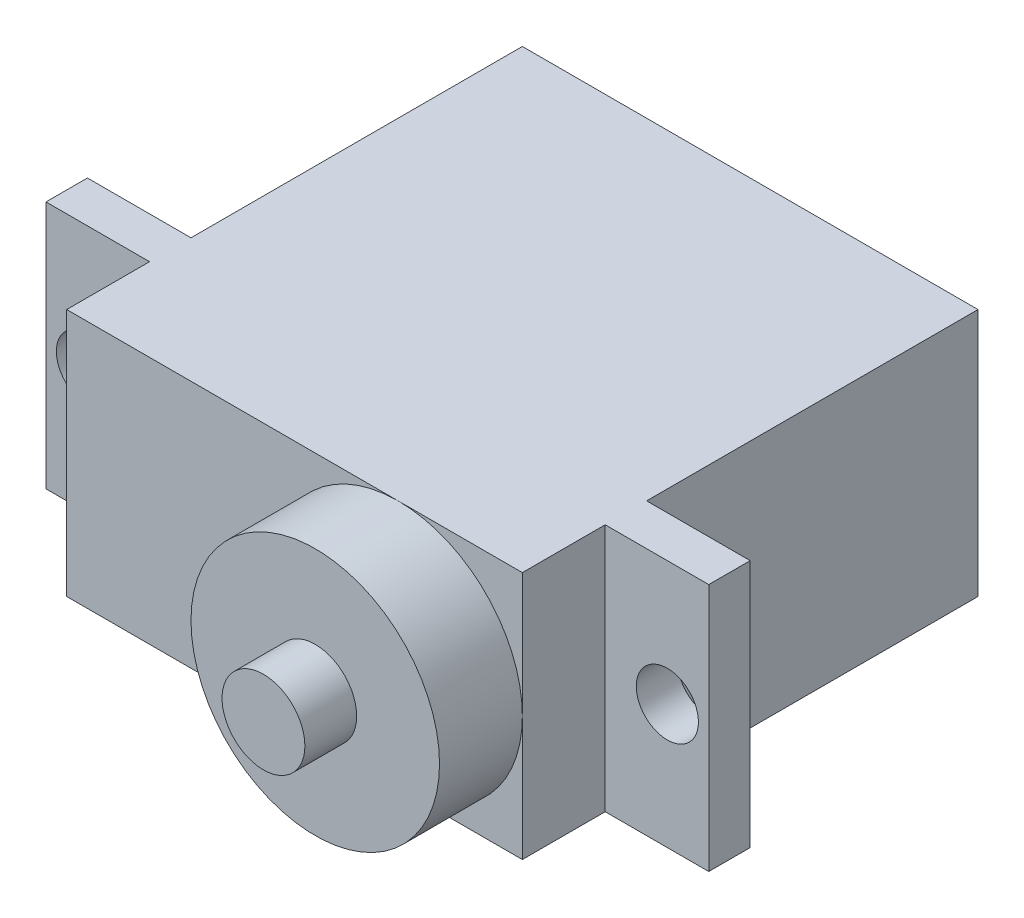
ISO-10303-21;
HEADER;
FILE_DESCRIPTION(('STEP AP214'),'2;1');
FILE_NAME('part.step','',(''),(''),'','','');
FILE_SCHEMA(('AUTOMOTIVE_DESIGN { 1 0 10303 214 1 1 1 1 }'));
ENDSEC;
DATA;
#1=APPLICATION_CONTEXT('core data for automotive mechanical design processes');
#2=APPLICATION_PROTOCOL_DEFINITION('international standard','automotive_design',2000,#1);
#3=PRODUCT_CONTEXT('',#1,'mechanical');
#4=PRODUCT('Part','Part','',(#3));
#5=PRODUCT_RELATED_PRODUCT_CATEGORY('part','',(#4));
#6=PRODUCT_DEFINITION_FORMATION('','',#4);
#7=PRODUCT_DEFINITION_CONTEXT('part definition',#1,'design');
#8=PRODUCT_DEFINITION('design','',#6,#7);
#9=PRODUCT_DEFINITION_SHAPE('','',#8);
#10=(LENGTH_UNIT() NAMED_UNIT(*) SI_UNIT(.MILLI.,.METRE.));
#11=(NAMED_UNIT(*) PLANE_ANGLE_UNIT() SI_UNIT($,.RADIAN.));
#12=(NAMED_UNIT(*) SI_UNIT($,.STERADIAN.) SOLID_ANGLE_UNIT());
#13=UNCERTAINTY_MEASURE_WITH_UNIT(LENGTH_MEASURE(1.E-05),#10,'distance_accuracy_value','');
#14=(GEOMETRIC_REPRESENTATION_CONTEXT(3) GLOBAL_UNCERTAINTY_ASSIGNED_CONTEXT((#13)) GLOBAL_UNIT_ASSIGNED_CONTEXT((#10,
#11,#12)) REPRESENTATION_CONTEXT('',''));
#15=CARTESIAN_POINT('',(0.,0.,0.));
#16=DIRECTION('',(0.,0.,1.));
#17=DIRECTION('',(1.,0.,0.));
#18=AXIS2_PLACEMENT_3D('',#15,#16,#17);
#19=CARTESIAN_POINT('',(0.,0.,22.));
#20=DIRECTION('',(0.,0.,1.));
#21=DIRECTION('',(1.,0.,0.));
#22=AXIS2_PLACEMENT_3D('',#19,#20,#21);
#23=PLANE('',#22);
#24=CARTESIAN_POINT('',(-1.83967744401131,2.32380952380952,22.));
#25=DIRECTION('',(0.,0.,1.));
#26=DIRECTION('',(1.,0.,0.));
#27=AXIS2_PLACEMENT_3D('',#24,#25,#26);
#28=CIRCLE('',#27,6.);
#29=CARTESIAN_POINT('',(4.16032255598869,2.32380952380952,22.));
#30=VERTEX_POINT('',#29);
#31=CARTESIAN_POINT('',(-1.83967744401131,8.32380952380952,22.));
#32=VERTEX_POINT('',#31);
#33=EDGE_CURVE('E44',#30,#32,#28,.T.);
#34=ORIENTED_EDGE('',*,*,#33,.F.);
#35=DIRECTION('',(0.,1.,0.));
#36=VECTOR('',#35,1.);
#37=CARTESIAN_POINT('',(4.16032255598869,8.32380952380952,22.));
#38=LINE('',#37,#36);
#39=CARTESIAN_POINT('',(4.16032255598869,8.32380952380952,22.));
#40=VERTEX_POINT('',#39);
#41=EDGE_CURVE('E137',#30,#40,#38,.T.);
#42=ORIENTED_EDGE('',*,*,#41,.T.);
#43=DIRECTION('',(-1.,0.,0.));
#44=VECTOR('',#43,1.);
#45=CARTESIAN_POINT('',(-17.8396774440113,8.32380952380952,22.));
#46=LINE('',#45,#44);
#47=EDGE_CURVE('E149',#40,#32,#46,.T.);
#48=ORIENTED_EDGE('',*,*,#47,.T.);
#49=EDGE_LOOP('',(#34,#42,#48));
#50=FACE_BOUND('',#49,.T.);
#51=ADVANCED_FACE('F33',(#50),#23,.T.);
#52=CARTESIAN_POINT('',(-1.83967744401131,-3.67619047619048,22.));
#53=VERTEX_POINT('',#52);
#54=EDGE_CURVE('E11',#32,#53,#28,.T.);
#55=ORIENTED_EDGE('',*,*,#54,.F.);
#56=CARTESIAN_POINT('',(-17.8396774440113,8.32380952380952,22.));
#57=VERTEX_POINT('',#56);
#58=EDGE_CURVE('E136',#32,#57,#46,.T.);
#59=ORIENTED_EDGE('',*,*,#58,.T.);
#60=DIRECTION('',(0.,-1.,0.));
#61=VECTOR('',#60,1.);
#62=CARTESIAN_POINT('',(-17.8396774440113,8.32380952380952,22.));
#63=LINE('',#62,#61);
#64=CARTESIAN_POINT('',(-17.8396774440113,-3.67619047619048,22.));
#65=VERTEX_POINT('',#64);
#66=EDGE_CURVE('E214',#57,#65,#63,.T.);
#67=ORIENTED_EDGE('',*,*,#66,.T.);
#68=DIRECTION('',(1.,0.,0.));
#69=VECTOR('',#68,1.);
#70=CARTESIAN_POINT('',(-17.8396774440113,-3.67619047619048,22.));
#71=LINE('',#70,#69);
#72=EDGE_CURVE('E147',#65,#53,#71,.T.);
#73=ORIENTED_EDGE('',*,*,#72,.T.);
#74=EDGE_LOOP('',(#55,#59,#67,#73));
#75=FACE_BOUND('',#74,.T.);
#76=ADVANCED_FACE('F266',(#75),#23,.T.);
#77=CARTESIAN_POINT('',(-17.8396774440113,8.32380952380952,22.));
#78=DIRECTION('',(1.,0.,0.));
#79=DIRECTION('',(0.,0.,-1.));
#80=AXIS2_PLACEMENT_3D('',#77,#78,#79);
#81=PLANE('',#80);
#82=DIRECTION('',(0.,1.,0.));
#83=VECTOR('',#82,1.);
#84=CARTESIAN_POINT('',(-17.8396774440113,8.32380952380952,18.));
#85=LINE('',#84,#83);
#86=CARTESIAN_POINT('',(-17.8396774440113,-3.67619047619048,18.));
#87=VERTEX_POINT('',#86);
#88=CARTESIAN_POINT('',(-17.8396774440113,8.32380952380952,18.));
#89=VERTEX_POINT('',#88);
#90=EDGE_CURVE('E170',#87,#89,#85,.T.);
#91=ORIENTED_EDGE('',*,*,#90,.F.);
#92=DIRECTION('',(0.,0.,-1.));
#93=VECTOR('',#92,1.);
#94=CARTESIAN_POINT('',(-17.8396774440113,-3.67619047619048,22.));
#95=LINE('',#94,#93);
#96=EDGE_CURVE('E37',#65,#87,#95,.T.);
#97=ORIENTED_EDGE('',*,*,#96,.F.);
#98=ORIENTED_EDGE('',*,*,#66,.F.);
#99=DIRECTION('',(0.,0.,-1.));
#100=VECTOR('',#99,1.);
#101=CARTESIAN_POINT('',(-17.8396774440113,8.32380952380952,22.));
#102=LINE('',#101,#100);
#103=EDGE_CURVE('E231',#57,#89,#102,.T.);
#104=ORIENTED_EDGE('',*,*,#103,.T.);
#105=EDGE_LOOP('',(#91,#97,#98,#104));
#106=FACE_BOUND('',#105,.T.);
#107=ADVANCED_FACE('F35',(#106),#81,.F.);
#108=DIRECTION('',(0.,-1.,0.));
#109=VECTOR('',#108,1.);
#110=CARTESIAN_POINT('',(-17.8396774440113,8.32380952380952,16.));
#111=LINE('',#110,#109);
#112=CARTESIAN_POINT('',(-17.8396774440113,8.32380952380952,16.));
#113=VERTEX_POINT('',#112);
#114=CARTESIAN_POINT('',(-17.8396774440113,-3.67619047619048,16.));
#115=VERTEX_POINT('',#114);
#116=EDGE_CURVE('E163',#113,#115,#111,.T.);
#117=ORIENTED_EDGE('',*,*,#116,.F.);
#118=CARTESIAN_POINT('',(-17.8396774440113,8.32380952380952,0.));
#119=VERTEX_POINT('',#118);
#120=EDGE_CURVE('E220',#113,#119,#102,.T.);
#121=ORIENTED_EDGE('',*,*,#120,.T.);
#122=DIRECTION('',(0.,-1.,0.));
#123=VECTOR('',#122,1.);
#124=CARTESIAN_POINT('',(-17.8396774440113,8.32380952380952,0.));
#125=LINE('',#124,#123);
#126=CARTESIAN_POINT('',(-17.8396774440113,-3.67619047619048,0.));
#127=VERTEX_POINT('',#126);
#128=EDGE_CURVE('E213',#119,#127,#125,.T.);
#129=ORIENTED_EDGE('',*,*,#128,.T.);
#130=EDGE_CURVE('E155',#115,#127,#95,.T.);
#131=ORIENTED_EDGE('',*,*,#130,.F.);
#132=EDGE_LOOP('',(#117,#121,#129,#131));
#133=FACE_BOUND('',#132,.T.);
#134=ADVANCED_FACE('F282',(#133),#81,.F.);
#135=CARTESIAN_POINT('',(4.16032255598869,8.32380952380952,22.));
#136=DIRECTION('',(-1.,0.,0.));
#137=DIRECTION('',(0.,-1.,0.));
#138=AXIS2_PLACEMENT_3D('',#135,#136,#137);
#139=PLANE('',#138);
#140=DIRECTION('',(0.,-1.,0.));
#141=VECTOR('',#140,1.);
#142=CARTESIAN_POINT('',(4.16032255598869,8.32380952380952,18.));
#143=LINE('',#142,#141);
#144=CARTESIAN_POINT('',(4.16032255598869,8.32380952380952,18.));
#145=VERTEX_POINT('',#144);
#146=CARTESIAN_POINT('',(4.16032255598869,-3.67619047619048,18.));
#147=VERTEX_POINT('',#146);
#148=EDGE_CURVE('E186',#145,#147,#143,.T.);
#149=ORIENTED_EDGE('',*,*,#148,.F.);
#150=DIRECTION('',(0.,0.,-1.));
#151=VECTOR('',#150,1.);
#152=CARTESIAN_POINT('',(4.16032255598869,8.32380952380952,22.));
#153=LINE('',#152,#151);
#154=EDGE_CURVE('E143',#40,#145,#153,.T.);
#155=ORIENTED_EDGE('',*,*,#154,.F.);
#156=ORIENTED_EDGE('',*,*,#41,.F.);
#157=CARTESIAN_POINT('',(4.16032255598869,-3.67619047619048,22.));
#158=VERTEX_POINT('',#157);
#159=EDGE_CURVE('E130',#158,#30,#38,.T.);
#160=ORIENTED_EDGE('',*,*,#159,.F.);
#161=DIRECTION('',(0.,0.,-1.));
#162=VECTOR('',#161,1.);
#163=CARTESIAN_POINT('',(4.16032255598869,-3.67619047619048,22.));
#164=LINE('',#163,#162);
#165=EDGE_CURVE('E235',#158,#147,#164,.T.);
#166=ORIENTED_EDGE('',*,*,#165,.T.);
#167=EDGE_LOOP('',(#149,#155,#156,#160,#166));
#168=FACE_BOUND('',#167,.T.);
#169=ADVANCED_FACE('F141',(#168),#139,.F.);
#170=DIRECTION('',(0.,1.,0.));
#171=VECTOR('',#170,1.);
#172=CARTESIAN_POINT('',(4.16032255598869,8.32380952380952,16.));
#173=LINE('',#172,#171);
#174=CARTESIAN_POINT('',(4.16032255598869,-3.67619047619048,16.));
#175=VERTEX_POINT('',#174);
#176=CARTESIAN_POINT('',(4.16032255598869,8.32380952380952,16.));
#177=VERTEX_POINT('',#176);
#178=EDGE_CURVE('E191',#175,#177,#173,.T.);
#179=ORIENTED_EDGE('',*,*,#178,.F.);
#180=CARTESIAN_POINT('',(4.16032255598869,-3.67619047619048,0.));
#181=VERTEX_POINT('',#180);
#182=EDGE_CURVE('E234',#175,#181,#164,.T.);
#183=ORIENTED_EDGE('',*,*,#182,.T.);
#184=DIRECTION('',(0.,1.,0.));
#185=VECTOR('',#184,1.);
#186=CARTESIAN_POINT('',(4.16032255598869,8.32380952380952,0.));
#187=LINE('',#186,#185);
#188=CARTESIAN_POINT('',(4.16032255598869,8.32380952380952,0.));
#189=VERTEX_POINT('',#188);
#190=EDGE_CURVE('E226',#181,#189,#187,.T.);
#191=ORIENTED_EDGE('',*,*,#190,.T.);
#192=EDGE_CURVE('E233',#177,#189,#153,.T.);
#193=ORIENTED_EDGE('',*,*,#192,.F.);
#194=EDGE_LOOP('',(#179,#183,#191,#193));
#195=FACE_BOUND('',#194,.T.);
#196=ADVANCED_FACE('F238',(#195),#139,.F.);
#197=CARTESIAN_POINT('',(-17.8396774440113,-3.67619047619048,22.));
#198=DIRECTION('',(0.,1.,0.));
#199=DIRECTION('',(0.,0.,1.));
#200=AXIS2_PLACEMENT_3D('',#197,#198,#199);
#201=PLANE('',#200);
#202=DIRECTION('',(1.,0.,0.));
#203=VECTOR('',#202,1.);
#204=CARTESIAN_POINT('',(-17.8396774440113,-3.67619047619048,0.));
#205=LINE('',#204,#203);
#206=EDGE_CURVE('E223',#127,#181,#205,.T.);
#207=ORIENTED_EDGE('',*,*,#206,.T.);
#208=ORIENTED_EDGE('',*,*,#182,.F.);
#209=DIRECTION('',(-1.,0.,0.));
#210=VECTOR('',#209,1.);
#211=CARTESIAN_POINT('',(9.16032255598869,-3.67619047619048,16.));
#212=LINE('',#211,#210);
#213=CARTESIAN_POINT('',(9.16032255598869,-3.67619047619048,16.));
#214=VERTEX_POINT('',#213);
#215=EDGE_CURVE('E207',#214,#175,#212,.T.);
#216=ORIENTED_EDGE('',*,*,#215,.F.);
#217=DIRECTION('',(0.,0.,-1.));
#218=VECTOR('',#217,1.);
#219=CARTESIAN_POINT('',(9.16032255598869,-3.67619047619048,18.));
#220=LINE('',#219,#218);
#221=CARTESIAN_POINT('',(9.16032255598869,-3.67619047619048,18.));
#222=VERTEX_POINT('',#221);
#223=EDGE_CURVE('E190',#222,#214,#220,.T.);
#224=ORIENTED_EDGE('',*,*,#223,.F.);
#225=DIRECTION('',(-1.,0.,0.));
#226=VECTOR('',#225,1.);
#227=CARTESIAN_POINT('',(9.16032255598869,-3.67619047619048,18.));
#228=LINE('',#227,#226);
#229=EDGE_CURVE('E210',#222,#147,#228,.T.);
#230=ORIENTED_EDGE('',*,*,#229,.T.);
#231=ORIENTED_EDGE('',*,*,#165,.F.);
#232=EDGE_CURVE('E133',#53,#158,#71,.T.);
#233=ORIENTED_EDGE('',*,*,#232,.F.);
#234=ORIENTED_EDGE('',*,*,#72,.F.);
#235=ORIENTED_EDGE('',*,*,#96,.T.);
#236=DIRECTION('',(1.,0.,0.));
#237=VECTOR('',#236,1.);
#238=CARTESIAN_POINT('',(-22.8396774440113,-3.67619047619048,18.));
#239=LINE('',#238,#237);
#240=CARTESIAN_POINT('',(-22.8396774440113,-3.67619047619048,18.));
#241=VERTEX_POINT('',#240);
#242=EDGE_CURVE('E169',#241,#87,#239,.T.);
#243=ORIENTED_EDGE('',*,*,#242,.F.);
#244=DIRECTION('',(0.,0.,1.));
#245=VECTOR('',#244,1.);
#246=CARTESIAN_POINT('',(-22.8396774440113,-3.67619047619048,18.));
#247=LINE('',#246,#245);
#248=CARTESIAN_POINT('',(-22.8396774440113,-3.67619047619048,16.));
#249=VERTEX_POINT('',#248);
#250=EDGE_CURVE('E167',#249,#241,#247,.T.);
#251=ORIENTED_EDGE('',*,*,#250,.F.);
#252=DIRECTION('',(1.,0.,0.));
#253=VECTOR('',#252,1.);
#254=CARTESIAN_POINT('',(-22.8396774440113,-3.67619047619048,16.));
#255=LINE('',#254,#253);
#256=EDGE_CURVE('E177',#249,#115,#255,.T.);
#257=ORIENTED_EDGE('',*,*,#256,.T.);
#258=ORIENTED_EDGE('',*,*,#130,.T.);
#259=EDGE_LOOP('',(#207,#208,#216,#224,#230,#231,#233,#234,#235,#243,#251,#257,#258));
#260=FACE_BOUND('',#259,.T.);
#261=ADVANCED_FACE('F244',(#260),#201,.F.);
#262=CARTESIAN_POINT('',(-17.8396774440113,8.32380952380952,22.));
#263=DIRECTION('',(0.,-1.,0.));
#264=DIRECTION('',(0.,0.,-1.));
#265=AXIS2_PLACEMENT_3D('',#262,#263,#264);
#266=PLANE('',#265);
#267=DIRECTION('',(-1.,0.,0.));
#268=VECTOR('',#267,1.);
#269=CARTESIAN_POINT('',(-17.8396774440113,8.32380952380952,0.));
#270=LINE('',#269,#268);
#271=EDGE_CURVE('E217',#189,#119,#270,.T.);
#272=ORIENTED_EDGE('',*,*,#271,.T.);
#273=ORIENTED_EDGE('',*,*,#120,.F.);
#274=DIRECTION('',(1.,0.,0.));
#275=VECTOR('',#274,1.);
#276=CARTESIAN_POINT('',(-22.8396774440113,8.32380952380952,16.));
#277=LINE('',#276,#275);
#278=CARTESIAN_POINT('',(-22.8396774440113,8.32380952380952,16.));
#279=VERTEX_POINT('',#278);
#280=EDGE_CURVE('E180',#279,#113,#277,.T.);
#281=ORIENTED_EDGE('',*,*,#280,.F.);
#282=DIRECTION('',(0.,0.,-1.));
#283=VECTOR('',#282,1.);
#284=CARTESIAN_POINT('',(-22.8396774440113,8.32380952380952,18.));
#285=LINE('',#284,#283);
#286=CARTESIAN_POINT('',(-22.8396774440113,8.32380952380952,18.));
#287=VERTEX_POINT('',#286);
#288=EDGE_CURVE('E162',#287,#279,#285,.T.);
#289=ORIENTED_EDGE('',*,*,#288,.F.);
#290=DIRECTION('',(1.,0.,0.));
#291=VECTOR('',#290,1.);
#292=CARTESIAN_POINT('',(-22.8396774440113,8.32380952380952,18.));
#293=LINE('',#292,#291);
#294=EDGE_CURVE('E183',#287,#89,#293,.T.);
#295=ORIENTED_EDGE('',*,*,#294,.T.);
#296=ORIENTED_EDGE('',*,*,#103,.F.);
#297=ORIENTED_EDGE('',*,*,#58,.F.);
#298=ORIENTED_EDGE('',*,*,#47,.F.);
#299=ORIENTED_EDGE('',*,*,#154,.T.);
#300=DIRECTION('',(-1.,0.,0.));
#301=VECTOR('',#300,1.);
#302=CARTESIAN_POINT('',(9.16032255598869,8.32380952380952,18.));
#303=LINE('',#302,#301);
#304=CARTESIAN_POINT('',(9.16032255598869,8.32380952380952,18.));
#305=VERTEX_POINT('',#304);
#306=EDGE_CURVE('E197',#305,#145,#303,.T.);
#307=ORIENTED_EDGE('',*,*,#306,.F.);
#308=DIRECTION('',(0.,0.,1.));
#309=VECTOR('',#308,1.);
#310=CARTESIAN_POINT('',(9.16032255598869,8.32380952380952,18.));
#311=LINE('',#310,#309);
#312=CARTESIAN_POINT('',(9.16032255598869,8.32380952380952,16.));
#313=VERTEX_POINT('',#312);
#314=EDGE_CURVE('E195',#313,#305,#311,.T.);
#315=ORIENTED_EDGE('',*,*,#314,.F.);
#316=DIRECTION('',(-1.,0.,0.));
#317=VECTOR('',#316,1.);
#318=CARTESIAN_POINT('',(9.16032255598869,8.32380952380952,16.));
#319=LINE('',#318,#317);
#320=EDGE_CURVE('E204',#313,#177,#319,.T.);
#321=ORIENTED_EDGE('',*,*,#320,.T.);
#322=ORIENTED_EDGE('',*,*,#192,.T.);
#323=EDGE_LOOP('',(#272,#273,#281,#289,#295,#296,#297,#298,#299,#307,#315,#321,#322));
#324=FACE_BOUND('',#323,.T.);
#325=ADVANCED_FACE('F250',(#324),#266,.F.);
#326=EDGE_CURVE('E42',#53,#30,#28,.T.);
#327=ORIENTED_EDGE('',*,*,#326,.F.);
#328=ORIENTED_EDGE('',*,*,#232,.T.);
#329=ORIENTED_EDGE('',*,*,#159,.T.);
#330=EDGE_LOOP('',(#327,#328,#329));
#331=FACE_BOUND('',#330,.T.);
#332=ADVANCED_FACE('F132',(#331),#23,.T.);
#333=CARTESIAN_POINT('',(0.,0.,0.));
#334=DIRECTION('',(0.,0.,1.));
#335=DIRECTION('',(1.,0.,0.));
#336=AXIS2_PLACEMENT_3D('',#333,#334,#335);
#337=PLANE('',#336);
#338=ORIENTED_EDGE('',*,*,#128,.F.);
#339=ORIENTED_EDGE('',*,*,#271,.F.);
#340=ORIENTED_EDGE('',*,*,#190,.F.);
#341=ORIENTED_EDGE('',*,*,#206,.F.);
#342=EDGE_LOOP('',(#338,#339,#340,#341));
#343=FACE_BOUND('',#342,.T.);
#344=ADVANCED_FACE('F247',(#343),#337,.F.);
#345=CARTESIAN_POINT('',(9.16032255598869,8.32380952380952,18.));
#346=DIRECTION('',(0.,0.,-1.));
#347=DIRECTION('',(-1.,0.,0.));
#348=AXIS2_PLACEMENT_3D('',#345,#346,#347);
#349=PLANE('',#348);
#350=CARTESIAN_POINT('',(7.16032255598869,2.32380952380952,18.));
#351=DIRECTION('',(0.,0.,1.));
#352=DIRECTION('',(1.,0.,0.));
#353=AXIS2_PLACEMENT_3D('',#350,#351,#352);
#354=CIRCLE('',#353,1.5);
#355=CARTESIAN_POINT('',(8.66032255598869,2.32380952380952,18.));
#356=VERTEX_POINT('',#355);
#357=EDGE_CURVE('E472',#356,#356,#354,.T.);
#358=ORIENTED_EDGE('',*,*,#357,.F.);
#359=EDGE_LOOP('',(#358));
#360=FACE_BOUND('',#359,.T.);
#361=ORIENTED_EDGE('',*,*,#148,.T.);
#362=ORIENTED_EDGE('',*,*,#229,.F.);
#363=DIRECTION('',(0.,-1.,0.));
#364=VECTOR('',#363,1.);
#365=CARTESIAN_POINT('',(9.16032255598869,8.32380952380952,18.));
#366=LINE('',#365,#364);
#367=EDGE_CURVE('E187',#305,#222,#366,.T.);
#368=ORIENTED_EDGE('',*,*,#367,.F.);
#369=ORIENTED_EDGE('',*,*,#306,.T.);
#370=EDGE_LOOP('',(#361,#362,#368,#369));
#371=FACE_BOUND('',#370,.T.);
#372=ADVANCED_FACE('F263',(#360,#371),#349,.F.);
#373=CARTESIAN_POINT('',(9.16032255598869,8.32380952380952,16.));
#374=DIRECTION('',(0.,0.,1.));
#375=DIRECTION('',(1.,0.,0.));
#376=AXIS2_PLACEMENT_3D('',#373,#374,#375);
#377=PLANE('',#376);
#378=CARTESIAN_POINT('',(7.16032255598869,2.32380952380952,16.));
#379=DIRECTION('',(0.,0.,1.));
#380=DIRECTION('',(1.,0.,0.));
#381=AXIS2_PLACEMENT_3D('',#378,#379,#380);
#382=CIRCLE('',#381,1.5);
#383=CARTESIAN_POINT('',(8.66032255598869,2.32380952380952,16.));
#384=VERTEX_POINT('',#383);
#385=EDGE_CURVE('E475',#384,#384,#382,.F.);
#386=ORIENTED_EDGE('',*,*,#385,.F.);
#387=EDGE_LOOP('',(#386));
#388=FACE_BOUND('',#387,.T.);
#389=ORIENTED_EDGE('',*,*,#178,.T.);
#390=ORIENTED_EDGE('',*,*,#320,.F.);
#391=DIRECTION('',(0.,1.,0.));
#392=VECTOR('',#391,1.);
#393=CARTESIAN_POINT('',(9.16032255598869,8.32380952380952,16.));
#394=LINE('',#393,#392);
#395=EDGE_CURVE('E193',#214,#313,#394,.T.);
#396=ORIENTED_EDGE('',*,*,#395,.F.);
#397=ORIENTED_EDGE('',*,*,#215,.T.);
#398=EDGE_LOOP('',(#389,#390,#396,#397));
#399=FACE_BOUND('',#398,.T.);
#400=ADVANCED_FACE('F255',(#388,#399),#377,.F.);
#401=CARTESIAN_POINT('',(9.16032255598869,0.,0.));
#402=DIRECTION('',(1.,0.,0.));
#403=DIRECTION('',(0.,1.,0.));
#404=AXIS2_PLACEMENT_3D('',#401,#402,#403);
#405=PLANE('',#404);
#406=ORIENTED_EDGE('',*,*,#367,.T.);
#407=ORIENTED_EDGE('',*,*,#223,.T.);
#408=ORIENTED_EDGE('',*,*,#395,.T.);
#409=ORIENTED_EDGE('',*,*,#314,.T.);
#410=EDGE_LOOP('',(#406,#407,#408,#409));
#411=FACE_BOUND('',#410,.T.);
#412=ADVANCED_FACE('F260',(#411),#405,.T.);
#413=CARTESIAN_POINT('',(-22.8396774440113,8.32380952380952,18.));
#414=DIRECTION('',(0.,0.,-1.));
#415=DIRECTION('',(-1.,0.,0.));
#416=AXIS2_PLACEMENT_3D('',#413,#414,#415);
#417=PLANE('',#416);
#418=CARTESIAN_POINT('',(-20.8396774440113,2.32380952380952,18.));
#419=DIRECTION('',(0.,0.,1.));
#420=DIRECTION('',(1.,0.,0.));
#421=AXIS2_PLACEMENT_3D('',#418,#419,#420);
#422=CIRCLE('',#421,1.5);
#423=CARTESIAN_POINT('',(-19.3396774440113,2.32380952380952,18.));
#424=VERTEX_POINT('',#423);
#425=EDGE_CURVE('E468',#424,#424,#422,.T.);
#426=ORIENTED_EDGE('',*,*,#425,.F.);
#427=EDGE_LOOP('',(#426));
#428=FACE_BOUND('',#427,.T.);
#429=ORIENTED_EDGE('',*,*,#90,.T.);
#430=ORIENTED_EDGE('',*,*,#294,.F.);
#431=DIRECTION('',(0.,1.,0.));
#432=VECTOR('',#431,1.);
#433=CARTESIAN_POINT('',(-22.8396774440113,8.32380952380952,18.));
#434=LINE('',#433,#432);
#435=EDGE_CURVE('E159',#241,#287,#434,.T.);
#436=ORIENTED_EDGE('',*,*,#435,.F.);
#437=ORIENTED_EDGE('',*,*,#242,.T.);
#438=EDGE_LOOP('',(#429,#430,#436,#437));
#439=FACE_BOUND('',#438,.T.);
#440=ADVANCED_FACE('F273',(#428,#439),#417,.F.);
#441=CARTESIAN_POINT('',(-22.8396774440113,8.32380952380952,16.));
#442=DIRECTION('',(0.,0.,1.));
#443=DIRECTION('',(0.,-1.,0.));
#444=AXIS2_PLACEMENT_3D('',#441,#442,#443);
#445=PLANE('',#444);
#446=CARTESIAN_POINT('',(-20.8396774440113,2.32380952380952,16.));
#447=DIRECTION('',(0.,0.,1.));
#448=DIRECTION('',(0.,-1.,0.));
#449=AXIS2_PLACEMENT_3D('',#446,#447,#448);
#450=CIRCLE('',#449,1.5);
#451=CARTESIAN_POINT('',(-20.8396774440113,0.823809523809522,16.));
#452=VERTEX_POINT('',#451);
#453=EDGE_CURVE('E471',#452,#452,#450,.F.);
#454=ORIENTED_EDGE('',*,*,#453,.F.);
#455=EDGE_LOOP('',(#454));
#456=FACE_BOUND('',#455,.T.);
#457=ORIENTED_EDGE('',*,*,#116,.T.);
#458=ORIENTED_EDGE('',*,*,#256,.F.);
#459=DIRECTION('',(0.,-1.,0.));
#460=VECTOR('',#459,1.);
#461=CARTESIAN_POINT('',(-22.8396774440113,8.32380952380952,16.));
#462=LINE('',#461,#460);
#463=EDGE_CURVE('E165',#279,#249,#462,.T.);
#464=ORIENTED_EDGE('',*,*,#463,.F.);
#465=ORIENTED_EDGE('',*,*,#280,.T.);
#466=EDGE_LOOP('',(#457,#458,#464,#465));
#467=FACE_BOUND('',#466,.T.);
#468=ADVANCED_FACE('F280',(#456,#467),#445,.F.);
#469=CARTESIAN_POINT('',(-22.8396774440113,0.,0.));
#470=DIRECTION('',(1.,0.,0.));
#471=DIRECTION('',(0.,0.,-1.));
#472=AXIS2_PLACEMENT_3D('',#469,#470,#471);
#473=PLANE('',#472);
#474=ORIENTED_EDGE('',*,*,#435,.T.);
#475=ORIENTED_EDGE('',*,*,#288,.T.);
#476=ORIENTED_EDGE('',*,*,#463,.T.);
#477=ORIENTED_EDGE('',*,*,#250,.T.);
#478=EDGE_LOOP('',(#474,#475,#476,#477));
#479=FACE_BOUND('',#478,.T.);
#480=ADVANCED_FACE('F276',(#479),#473,.F.);
#481=CARTESIAN_POINT('',(-1.83967744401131,2.32380952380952,26.));
#482=DIRECTION('',(0.,0.,-1.));
#483=DIRECTION('',(-1.,0.,0.));
#484=AXIS2_PLACEMENT_3D('',#481,#482,#483);
#485=CYLINDRICAL_SURFACE('',#484,6.);
#486=CARTESIAN_POINT('',(-1.83967744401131,2.32380952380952,26.));
#487=DIRECTION('',(0.,0.,1.));
#488=DIRECTION('',(1.,0.,0.));
#489=AXIS2_PLACEMENT_3D('',#486,#487,#488);
#490=CIRCLE('',#489,6.);
#491=CARTESIAN_POINT('',(4.16032255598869,2.32380952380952,26.));
#492=VERTEX_POINT('',#491);
#493=EDGE_CURVE('E151',#492,#492,#490,.T.);
#494=ORIENTED_EDGE('',*,*,#493,.F.);
#495=EDGE_LOOP('',(#494));
#496=FACE_BOUND('',#495,.T.);
#497=ORIENTED_EDGE('',*,*,#33,.T.);
#498=ORIENTED_EDGE('',*,*,#54,.T.);
#499=ORIENTED_EDGE('',*,*,#326,.T.);
#500=EDGE_LOOP('',(#497,#498,#499));
#501=FACE_BOUND('',#500,.T.);
#502=ADVANCED_FACE('F153',(#496,#501),#485,.T.);
#503=CARTESIAN_POINT('',(-1.83967744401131,2.32380952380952,26.));
#504=DIRECTION('',(0.,0.,1.));
#505=DIRECTION('',(1.,0.,0.));
#506=AXIS2_PLACEMENT_3D('',#503,#504,#505);
#507=PLANE('',#506);
#508=CARTESIAN_POINT('',(-1.83967744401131,2.32380952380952,26.));
#509=DIRECTION('',(0.,0.,1.));
#510=DIRECTION('',(1.,0.,0.));
#511=AXIS2_PLACEMENT_3D('',#508,#509,#510);
#512=CIRCLE('',#511,2.);
#513=CARTESIAN_POINT('',(0.160322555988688,2.32380952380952,26.));
#514=VERTEX_POINT('',#513);
#515=EDGE_CURVE('E481',#514,#514,#512,.T.);
#516=ORIENTED_EDGE('',*,*,#515,.F.);
#517=EDGE_LOOP('',(#516));
#518=FACE_BOUND('',#517,.T.);
#519=ORIENTED_EDGE('',*,*,#493,.T.);
#520=EDGE_LOOP('',(#519));
#521=FACE_BOUND('',#520,.T.);
#522=ADVANCED_FACE('F346',(#518,#521),#507,.T.);
#523=CARTESIAN_POINT('',(-1.83967744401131,2.32380952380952,28.5));
#524=DIRECTION('',(0.,0.,-1.));
#525=DIRECTION('',(-1.,0.,0.));
#526=AXIS2_PLACEMENT_3D('',#523,#524,#525);
#527=CYLINDRICAL_SURFACE('',#526,2.);
#528=CARTESIAN_POINT('',(-1.83967744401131,2.32380952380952,28.5));
#529=DIRECTION('',(0.,0.,1.));
#530=DIRECTION('',(1.,0.,0.));
#531=AXIS2_PLACEMENT_3D('',#528,#529,#530);
#532=CIRCLE('',#531,2.);
#533=CARTESIAN_POINT('',(0.160322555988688,2.32380952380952,28.5));
#534=VERTEX_POINT('',#533);
#535=EDGE_CURVE('E152',#534,#534,#532,.T.);
#536=ORIENTED_EDGE('',*,*,#535,.F.);
#537=EDGE_LOOP('',(#536));
#538=FACE_BOUND('',#537,.T.);
#539=ORIENTED_EDGE('',*,*,#515,.T.);
#540=EDGE_LOOP('',(#539));
#541=FACE_BOUND('',#540,.T.);
#542=ADVANCED_FACE('F358',(#538,#541),#527,.T.);
#543=CARTESIAN_POINT('',(-1.83967744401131,2.32380952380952,28.5));
#544=DIRECTION('',(0.,0.,1.));
#545=DIRECTION('',(1.,0.,0.));
#546=AXIS2_PLACEMENT_3D('',#543,#544,#545);
#547=PLANE('',#546);
#548=ORIENTED_EDGE('',*,*,#535,.T.);
#549=EDGE_LOOP('',(#548));
#550=FACE_BOUND('',#549,.T.);
#551=ADVANCED_FACE('F368',(#550),#547,.T.);
#552=CARTESIAN_POINT('',(7.16032255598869,2.32380952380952,-0.001000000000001));
#553=DIRECTION('',(0.,0.,1.));
#554=DIRECTION('',(1.,0.,0.));
#555=AXIS2_PLACEMENT_3D('',#552,#553,#554);
#556=CYLINDRICAL_SURFACE('',#555,1.5);
#557=ORIENTED_EDGE('',*,*,#357,.T.);
#558=EDGE_LOOP('',(#557));
#559=FACE_BOUND('',#558,.T.);
#560=ORIENTED_EDGE('',*,*,#385,.T.);
#561=EDGE_LOOP('',(#560));
#562=FACE_BOUND('',#561,.T.);
#563=ADVANCED_FACE('F378',(#559,#562),#556,.F.);
#564=CARTESIAN_POINT('',(-20.8396774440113,2.32380952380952,-0.001000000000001));
#565=DIRECTION('',(0.,0.,1.));
#566=DIRECTION('',(1.,0.,0.));
#567=AXIS2_PLACEMENT_3D('',#564,#565,#566);
#568=CYLINDRICAL_SURFACE('',#567,1.5);
#569=ORIENTED_EDGE('',*,*,#425,.T.);
#570=EDGE_LOOP('',(#569));
#571=FACE_BOUND('',#570,.T.);
#572=ORIENTED_EDGE('',*,*,#453,.T.);
#573=EDGE_LOOP('',(#572));
#574=FACE_BOUND('',#573,.T.);
#575=ADVANCED_FACE('F407',(#571,#574),#568,.F.);
#576=CLOSED_SHELL('',(#51,#76,#107,#134,#169,#196,#261,#325,#332,#344,#372,#400,#412,#440,#468,
#480,#502,#522,#542,#551,#563,#575));
#577=MANIFOLD_SOLID_BREP('B2',#576);
#578=ADVANCED_BREP_SHAPE_REPRESENTATION('',(#18,#577),#14);
#579=SHAPE_DEFINITION_REPRESENTATION(#9,#578);
ENDSEC;
END-ISO-10303-21;
